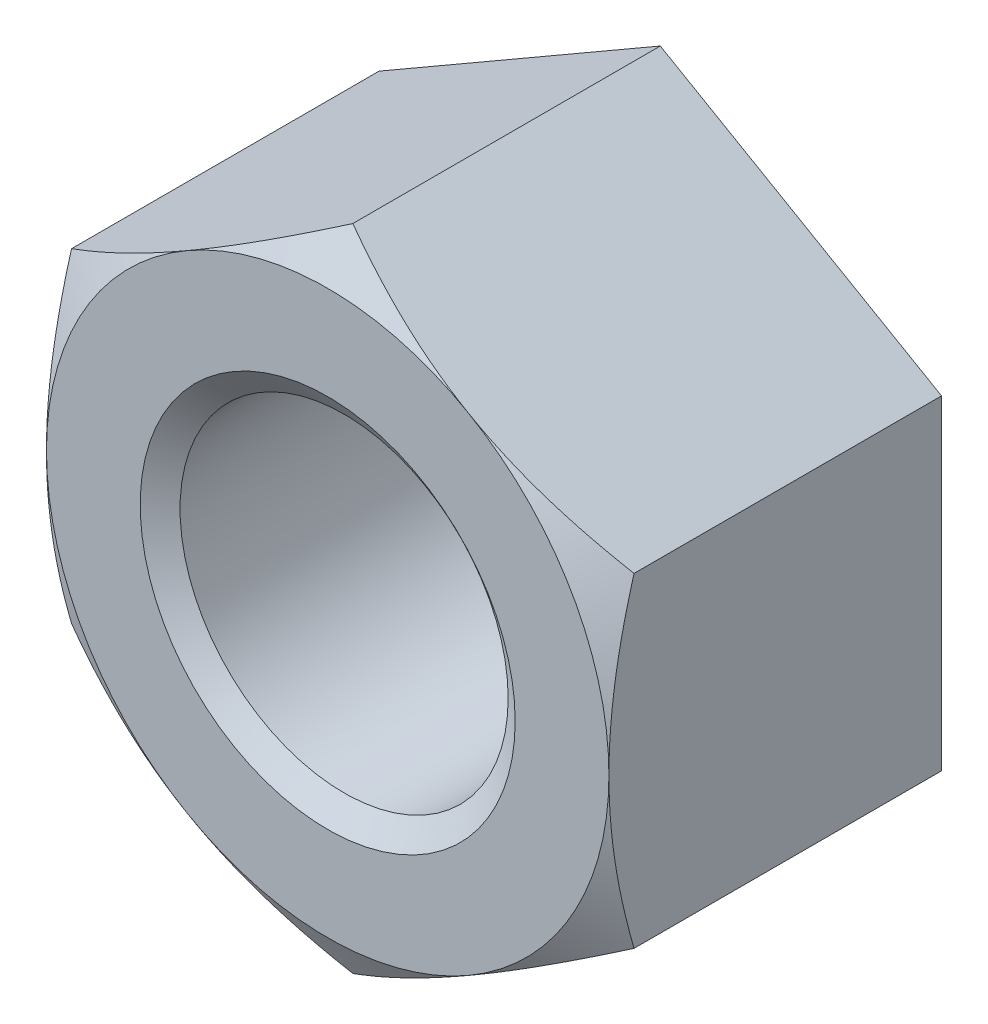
ISO-10303-21;
HEADER;
FILE_DESCRIPTION(('STEP AP214'),'2;1');
FILE_NAME('part.step','',(''),(''),'','','');
FILE_SCHEMA(('AUTOMOTIVE_DESIGN { 1 0 10303 214 1 1 1 1 }'));
ENDSEC;
DATA;
#1=APPLICATION_CONTEXT('core data for automotive mechanical design processes');
#2=APPLICATION_PROTOCOL_DEFINITION('international standard','automotive_design',2000,#1);
#3=PRODUCT_CONTEXT('',#1,'mechanical');
#4=PRODUCT('Part','Part','',(#3));
#5=PRODUCT_RELATED_PRODUCT_CATEGORY('part','',(#4));
#6=PRODUCT_DEFINITION_FORMATION('','',#4);
#7=PRODUCT_DEFINITION_CONTEXT('part definition',#1,'design');
#8=PRODUCT_DEFINITION('design','',#6,#7);
#9=PRODUCT_DEFINITION_SHAPE('','',#8);
#10=(LENGTH_UNIT() NAMED_UNIT(*) SI_UNIT(.MILLI.,.METRE.));
#11=(NAMED_UNIT(*) PLANE_ANGLE_UNIT() SI_UNIT($,.RADIAN.));
#12=(NAMED_UNIT(*) SI_UNIT($,.STERADIAN.) SOLID_ANGLE_UNIT());
#13=UNCERTAINTY_MEASURE_WITH_UNIT(LENGTH_MEASURE(1.E-05),#10,'distance_accuracy_value','');
#14=(GEOMETRIC_REPRESENTATION_CONTEXT(3) GLOBAL_UNCERTAINTY_ASSIGNED_CONTEXT((#13)) GLOBAL_UNIT_ASSIGNED_CONTEXT((#10,
#11,#12)) REPRESENTATION_CONTEXT('',''));
#15=CARTESIAN_POINT('',(0.,0.,0.));
#16=DIRECTION('',(0.,0.,1.));
#17=DIRECTION('',(1.,0.,0.));
#18=AXIS2_PLACEMENT_3D('',#15,#16,#17);
#19=CARTESIAN_POINT('',(0.,0.,-22.5298));
#20=DIRECTION('',(0.,0.,1.));
#21=DIRECTION('',(1.,0.,0.));
#22=AXIS2_PLACEMENT_3D('',#19,#20,#21);
#23=CYLINDRICAL_SURFACE('',#22,11.1125);
#24=CARTESIAN_POINT('',(0.,0.,-1.11157946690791));
#25=DIRECTION('',(0.,0.,1.));
#26=DIRECTION('',(1.,0.,0.));
#27=AXIS2_PLACEMENT_3D('',#24,#25,#26);
#28=CIRCLE('',#27,11.1125);
#29=CARTESIAN_POINT('',(11.1125,0.,-1.11157946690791));
#30=VERTEX_POINT('',#29);
#31=EDGE_CURVE('E130',#30,#30,#28,.F.);
#32=ORIENTED_EDGE('',*,*,#31,.F.);
#33=EDGE_LOOP('',(#32));
#34=FACE_BOUND('',#33,.T.);
#35=CARTESIAN_POINT('',(0.,0.,-21.3928205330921));
#36=DIRECTION('',(0.,0.,-1.));
#37=DIRECTION('',(-1.,0.,0.));
#38=AXIS2_PLACEMENT_3D('',#35,#36,#37);
#39=CIRCLE('',#38,11.1125);
#40=CARTESIAN_POINT('',(-11.1125,0.,-21.3928205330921));
#41=VERTEX_POINT('',#40);
#42=EDGE_CURVE('E40',#41,#41,#39,.F.);
#43=ORIENTED_EDGE('',*,*,#42,.F.);
#44=EDGE_LOOP('',(#43));
#45=FACE_BOUND('',#44,.T.);
#46=ADVANCED_FACE('F35',(#34,#45),#23,.F.);
#47=CARTESIAN_POINT('',(0.,21.9970452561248,-22.5298));
#48=DIRECTION('',(-0.500000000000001,0.866025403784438,0.));
#49=DIRECTION('',(-0.866025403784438,-0.500000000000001,0.));
#50=AXIS2_PLACEMENT_3D('',#47,#48,#49);
#51=PLANE('',#50);
#52=DIRECTION('',(0.,0.,1.));
#53=VECTOR('',#52,1.);
#54=CARTESIAN_POINT('',(-19.05,10.9985226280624,-22.5298));
#55=LINE('',#54,#53);
#56=CARTESIAN_POINT('',(-19.05,10.9985226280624,-22.5298));
#57=VERTEX_POINT('',#56);
#58=CARTESIAN_POINT('',(-19.05,10.9985226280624,-1.70147737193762));
#59=VERTEX_POINT('',#58);
#60=EDGE_CURVE('E242',#57,#59,#55,.T.);
#61=ORIENTED_EDGE('',*,*,#60,.T.);
#62=CARTESIAN_POINT('',(-19.0502,10.9984071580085,-1.70154403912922));
#63=CARTESIAN_POINT('',(-18.6314889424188,11.2401500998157,-1.56198341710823));
#64=CARTESIAN_POINT('',(-18.2111446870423,11.4828359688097,-1.42875584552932));
#65=CARTESIAN_POINT('',(-17.3670855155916,11.9701537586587,-1.17672716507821));
#66=CARTESIAN_POINT('',(-16.9433695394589,12.2147862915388,-1.05793080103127));
#67=CARTESIAN_POINT('',(-16.0917480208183,12.7064702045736,-0.836361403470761));
#68=CARTESIAN_POINT('',(-15.6638350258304,12.9535258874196,-0.733626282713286));
#69=CARTESIAN_POINT('',(-14.8050356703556,13.4493539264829,-0.54638543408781));
#70=CARTESIAN_POINT('',(-14.374149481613,13.6981261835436,-0.461878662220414));
#71=CARTESIAN_POINT('',(-13.5204444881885,14.1910129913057,-0.314688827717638));
#72=CARTESIAN_POINT('',(-13.0976890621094,14.4350909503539,-0.2515185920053));
#73=CARTESIAN_POINT('',(-12.250241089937,14.9243652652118,-0.145596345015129));
#74=CARTESIAN_POINT('',(-11.8255485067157,15.1695616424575,-0.102844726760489));
#75=CARTESIAN_POINT('',(-10.9754499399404,15.6603662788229,-0.0388391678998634));
#76=CARTESIAN_POINT('',(-10.5500454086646,15.9059736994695,-0.0175596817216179));
#77=CARTESIAN_POINT('',(-9.6988436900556,16.397415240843,0.00304398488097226));
#78=CARTESIAN_POINT('',(-9.27304651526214,16.6432493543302,0.00236884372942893));
#79=CARTESIAN_POINT('',(-8.47700964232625,17.1028414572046,-0.0194033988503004));
#80=CARTESIAN_POINT('',(-8.10671322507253,17.316632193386,-0.0378455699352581));
#81=CARTESIAN_POINT('',(-7.36700369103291,17.7437036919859,-0.0909844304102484));
#82=CARTESIAN_POINT('',(-6.99759056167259,17.9569844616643,-0.125680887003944));
#83=CARTESIAN_POINT('',(-6.25978756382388,18.3829552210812,-0.210726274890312));
#84=CARTESIAN_POINT('',(-5.89139892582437,18.5956445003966,-0.261089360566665));
#85=CARTESIAN_POINT('',(-5.15637533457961,19.0200105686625,-0.376579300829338));
#86=CARTESIAN_POINT('',(-4.78974037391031,19.2316873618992,-0.441706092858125));
#87=CARTESIAN_POINT('',(-3.67677271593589,19.8742595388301,-0.660888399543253));
#88=CARTESIAN_POINT('',(-2.93366305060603,20.3032941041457,-0.836799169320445));
#89=CARTESIAN_POINT('',(-1.45852420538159,21.1549659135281,-1.23604434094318));
#90=CARTESIAN_POINT('',(-0.726476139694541,21.5776140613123,-1.45928498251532));
#91=CARTESIAN_POINT('',(0.000200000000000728,21.9971607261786,-1.70154403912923));
#92=B_SPLINE_CURVE_WITH_KNOTS('',3,(#62,#63,#64,#65,#66,#67,#68,#69,#70,#71,#72,#73,#74,#75,#76,
#77,#78,#79,#80,#81,#82,#83,#84,#85,#86,#87,#88,#89,#90,#91),.UNSPECIFIED.,.F.,.F.,(4,2,2,2,2,2,
2,2,2,2,2,2,2,2,4),(0.,1.50971559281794,3.01992622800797,4.53364959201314,6.04728623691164,
7.52356313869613,8.99986845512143,10.4744153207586,11.9489166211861,13.2325441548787,
14.5161533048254,15.8009255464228,17.085692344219,19.7118183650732,22.3327898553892),.UNSPECIFIED.);
#93=CARTESIAN_POINT('',(-9.52500000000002,16.4977839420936,0.));
#94=VERTEX_POINT('',#93);
#95=EDGE_CURVE('E62',#59,#94,#92,.T.);
#96=ORIENTED_EDGE('',*,*,#95,.T.);
#97=CARTESIAN_POINT('',(0.,21.9970452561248,-1.70147737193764));
#98=VERTEX_POINT('',#97);
#99=EDGE_CURVE('E122',#94,#98,#92,.T.);
#100=ORIENTED_EDGE('',*,*,#99,.T.);
#101=DIRECTION('',(0.,0.,1.));
#102=VECTOR('',#101,1.);
#103=CARTESIAN_POINT('',(0.,21.9970452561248,-22.5298));
#104=LINE('',#103,#102);
#105=CARTESIAN_POINT('',(0.,21.9970452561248,-22.5298));
#106=VERTEX_POINT('',#105);
#107=EDGE_CURVE('E135',#106,#98,#104,.T.);
#108=ORIENTED_EDGE('',*,*,#107,.F.);
#109=DIRECTION('',(-0.866025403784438,-0.500000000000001,0.));
#110=VECTOR('',#109,1.);
#111=CARTESIAN_POINT('',(0.,21.9970452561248,-22.5298));
#112=LINE('',#111,#110);
#113=EDGE_CURVE('E136',#106,#57,#112,.T.);
#114=ORIENTED_EDGE('',*,*,#113,.T.);
#115=EDGE_LOOP('',(#61,#96,#100,#108,#114));
#116=FACE_BOUND('',#115,.T.);
#117=ADVANCED_FACE('F37',(#116),#51,.T.);
#118=CARTESIAN_POINT('',(19.05,10.9985226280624,-22.5298));
#119=DIRECTION('',(0.500000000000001,0.866025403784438,0.));
#120=DIRECTION('',(-0.866025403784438,0.500000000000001,0.));
#121=AXIS2_PLACEMENT_3D('',#118,#119,#120);
#122=PLANE('',#121);
#123=ORIENTED_EDGE('',*,*,#107,.T.);
#124=CARTESIAN_POINT('',(-0.000200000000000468,21.9971607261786,-1.70154403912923));
#125=CARTESIAN_POINT('',(0.418511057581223,21.7554177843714,-1.56198341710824));
#126=CARTESIAN_POINT('',(0.83885531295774,21.5127319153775,-1.42875584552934));
#127=CARTESIAN_POINT('',(1.68291448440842,21.0254141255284,-1.17672716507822));
#128=CARTESIAN_POINT('',(2.10663046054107,20.7807815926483,-1.05793080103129));
#129=CARTESIAN_POINT('',(2.95825197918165,20.2890976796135,-0.83636140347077));
#130=CARTESIAN_POINT('',(3.38616497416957,20.0420419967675,-0.733626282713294));
#131=CARTESIAN_POINT('',(4.24496432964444,19.5462139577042,-0.546385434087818));
#132=CARTESIAN_POINT('',(4.67585051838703,19.2974417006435,-0.461878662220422));
#133=CARTESIAN_POINT('',(5.52955551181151,18.8045548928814,-0.314688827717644));
#134=CARTESIAN_POINT('',(5.95231093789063,18.5604769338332,-0.251518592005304));
#135=CARTESIAN_POINT('',(6.79975891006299,18.0712026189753,-0.145596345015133));
#136=CARTESIAN_POINT('',(7.22445149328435,17.8260062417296,-0.102844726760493));
#137=CARTESIAN_POINT('',(8.07455006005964,17.3352016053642,-0.0388391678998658));
#138=CARTESIAN_POINT('',(8.49995459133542,17.0895941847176,-0.0175596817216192));
#139=CARTESIAN_POINT('',(9.35115630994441,16.5981526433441,0.00304398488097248));
#140=CARTESIAN_POINT('',(9.77695348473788,16.3523185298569,0.00236884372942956));
#141=CARTESIAN_POINT('',(10.5729903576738,15.8927264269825,-0.0194033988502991));
#142=CARTESIAN_POINT('',(10.9432867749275,15.6789356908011,-0.0378455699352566));
#143=CARTESIAN_POINT('',(11.6829963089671,15.2518641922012,-0.0909844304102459));
#144=CARTESIAN_POINT('',(12.0524094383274,15.0385834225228,-0.12568088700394));
#145=CARTESIAN_POINT('',(12.7902124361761,14.612612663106,-0.210726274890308));
#146=CARTESIAN_POINT('',(13.1586010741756,14.3999233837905,-0.261089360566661));
#147=CARTESIAN_POINT('',(13.8936246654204,13.9755573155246,-0.376579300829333));
#148=CARTESIAN_POINT('',(14.2602596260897,13.7638805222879,-0.441706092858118));
#149=CARTESIAN_POINT('',(15.3732272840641,13.121308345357,-0.660888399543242));
#150=CARTESIAN_POINT('',(16.116336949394,12.6922737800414,-0.836799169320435));
#151=CARTESIAN_POINT('',(17.5914757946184,11.840601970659,-1.23604434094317));
#152=CARTESIAN_POINT('',(18.3235238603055,11.4179538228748,-1.45928498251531));
#153=CARTESIAN_POINT('',(19.0502,10.9984071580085,-1.70154403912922));
#154=B_SPLINE_CURVE_WITH_KNOTS('',3,(#124,#125,#126,#127,#128,#129,#130,#131,#132,#133,#134,
#135,#136,#137,#138,#139,#140,#141,#142,#143,#144,#145,#146,#147,#148,#149,#150,#151,#152,#153),
.UNSPECIFIED.,.F.,.F.,(4,2,2,2,2,2,2,2,2,2,2,2,2,2,4),(0.,1.50971559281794,3.01992622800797,
4.53364959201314,6.04728623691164,7.52356313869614,8.99986845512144,10.4744153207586,
11.9489166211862,13.2325441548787,14.5161533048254,15.8009255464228,17.085692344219,
19.7118183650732,22.3327898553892),.UNSPECIFIED.);
#155=CARTESIAN_POINT('',(9.52500000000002,16.4977839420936,0.));
#156=VERTEX_POINT('',#155);
#157=EDGE_CURVE('E117',#98,#156,#154,.T.);
#158=ORIENTED_EDGE('',*,*,#157,.T.);
#159=CARTESIAN_POINT('',(19.05,10.9985226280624,-1.70147737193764));
#160=VERTEX_POINT('',#159);
#161=EDGE_CURVE('E109',#156,#160,#154,.T.);
#162=ORIENTED_EDGE('',*,*,#161,.T.);
#163=DIRECTION('',(0.,0.,1.));
#164=VECTOR('',#163,1.);
#165=CARTESIAN_POINT('',(19.05,10.9985226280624,-22.5298));
#166=LINE('',#165,#164);
#167=CARTESIAN_POINT('',(19.05,10.9985226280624,-22.5298));
#168=VERTEX_POINT('',#167);
#169=EDGE_CURVE('E254',#168,#160,#166,.T.);
#170=ORIENTED_EDGE('',*,*,#169,.F.);
#171=DIRECTION('',(-0.866025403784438,0.500000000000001,0.));
#172=VECTOR('',#171,1.);
#173=CARTESIAN_POINT('',(19.05,10.9985226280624,-22.5298));
#174=LINE('',#173,#172);
#175=EDGE_CURVE('E246',#168,#106,#174,.T.);
#176=ORIENTED_EDGE('',*,*,#175,.T.);
#177=EDGE_LOOP('',(#123,#158,#162,#170,#176));
#178=FACE_BOUND('',#177,.T.);
#179=ADVANCED_FACE('F133',(#178),#122,.T.);
#180=CARTESIAN_POINT('',(19.05,10.9985226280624,-22.5298));
#181=DIRECTION('',(-1.,0.,0.));
#182=DIRECTION('',(0.,0.,1.));
#183=AXIS2_PLACEMENT_3D('',#180,#181,#182);
#184=PLANE('',#183);
#185=CARTESIAN_POINT('',(19.05,-29.169702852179,-9.11593373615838));
#186=CARTESIAN_POINT('',(19.05,-28.7515170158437,-8.91378890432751));
#187=CARTESIAN_POINT('',(19.05,-28.3328257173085,-8.71269026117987));
#188=CARTESIAN_POINT('',(19.05,-27.494325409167,-8.31282549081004));
#189=CARTESIAN_POINT('',(19.05,-27.0745163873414,-8.11405938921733));
#190=CARTESIAN_POINT('',(19.05,-25.813129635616,-7.52156252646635));
#191=CARTESIAN_POINT('',(19.05,-24.9697281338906,-7.13169909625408));
#192=CARTESIAN_POINT('',(19.05,-23.2722707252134,-6.36257122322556));
#193=CARTESIAN_POINT('',(19.05,-22.4181814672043,-5.983380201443));
#194=CARTESIAN_POINT('',(19.05,-20.7029839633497,-5.24127883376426));
#195=CARTESIAN_POINT('',(19.05,-19.8418760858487,-4.87836763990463));
#196=CARTESIAN_POINT('',(19.05,-18.1005821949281,-4.16885698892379));
#197=CARTESIAN_POINT('',(19.05,-17.2202917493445,-3.82251248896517));
#198=CARTESIAN_POINT('',(19.05,-15.4493217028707,-3.15694792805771));
#199=CARTESIAN_POINT('',(19.05,-14.5586409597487,-2.83773088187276));
#200=CARTESIAN_POINT('',(19.05,-12.7673320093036,-2.23500280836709));
#201=CARTESIAN_POINT('',(19.05,-11.8667295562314,-1.95141586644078));
#202=CARTESIAN_POINT('',(19.05,-10.0526343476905,-1.4291439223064));
#203=CARTESIAN_POINT('',(19.05,-9.13914576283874,-1.19044473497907));
#204=CARTESIAN_POINT('',(19.05,-7.75907469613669,-0.87479986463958));
#205=CARTESIAN_POINT('',(19.05,-7.29731333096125,-0.77663607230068));
#206=CARTESIAN_POINT('',(19.05,-6.37071732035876,-0.595993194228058));
#207=CARTESIAN_POINT('',(19.05,-5.90588274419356,-0.513513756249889));
#208=CARTESIAN_POINT('',(19.05,-4.97345228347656,-0.365701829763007));
#209=CARTESIAN_POINT('',(19.05,-4.50585623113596,-0.300370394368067));
#210=CARTESIAN_POINT('',(19.05,-3.56843861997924,-0.188166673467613));
#211=CARTESIAN_POINT('',(19.05,-3.09861705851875,-0.141294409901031));
#212=CARTESIAN_POINT('',(19.05,-2.16041609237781,-0.0672708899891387));
#213=CARTESIAN_POINT('',(19.05,-1.69204648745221,-0.039996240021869));
#214=CARTESIAN_POINT('',(19.05,-0.754574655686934,-0.00531133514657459));
#215=CARTESIAN_POINT('',(19.05,-0.285472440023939,0.00209921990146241));
#216=CARTESIAN_POINT('',(19.05,0.652492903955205,-0.00311981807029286));
#217=CARTESIAN_POINT('',(19.05,1.12135606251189,-0.0157438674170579));
#218=CARTESIAN_POINT('',(19.05,2.05813737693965,-0.0607182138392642));
#219=CARTESIAN_POINT('',(19.05,2.52605549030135,-0.0930693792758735));
#220=CARTESIAN_POINT('',(19.05,3.65980250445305,-0.194680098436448));
#221=CARTESIAN_POINT('',(19.05,4.32476458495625,-0.273803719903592));
#222=CARTESIAN_POINT('',(19.05,5.64947952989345,-0.467485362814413));
#223=CARTESIAN_POINT('',(19.05,6.30923160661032,-0.582048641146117));
#224=CARTESIAN_POINT('',(19.05,8.28182382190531,-0.973151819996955));
#225=CARTESIAN_POINT('',(19.05,9.58542312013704,-1.29684470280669));
#226=CARTESIAN_POINT('',(19.05,11.5353898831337,-1.85499845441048));
#227=CARTESIAN_POINT('',(19.05,12.191945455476,-2.05588340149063));
#228=CARTESIAN_POINT('',(19.05,13.498713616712,-2.47768236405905));
#229=CARTESIAN_POINT('',(19.05,14.1489256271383,-2.69859818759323));
#230=CARTESIAN_POINT('',(19.05,15.439765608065,-3.15575174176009));
#231=CARTESIAN_POINT('',(19.05,16.0804269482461,-3.39189604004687));
#232=CARTESIAN_POINT('',(19.05,17.0373840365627,-3.75633654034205));
#233=CARTESIAN_POINT('',(19.05,17.3556458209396,-3.87949985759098));
#234=CARTESIAN_POINT('',(19.05,17.9909330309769,-4.12895791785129));
#235=CARTESIAN_POINT('',(19.05,18.3079584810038,-4.25525259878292));
#236=CARTESIAN_POINT('',(19.05,18.6244086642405,-4.38297164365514));
#237=B_SPLINE_CURVE_WITH_KNOTS('',3,(#185,#186,#187,#188,#189,#190,#191,#192,#193,#194,#195,
#196,#197,#198,#199,#200,#201,#202,#203,#204,#205,#206,#207,#208,#209,#210,#211,#212,#213,#214,
#215,#216,#217,#218,#219,#220,#221,#222,#223,#224,#225,#226,#227,#228,#229,#230,#231,#232,#233,
#234,#235,#236),.UNSPECIFIED.,.F.,.F.,(4,2,2,2,2,2,2,2,2,2,2,2,2,2,2,2,2,2,2,2,2,2,2,2,2,4),(0.,
1.39343811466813,2.78689152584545,5.57425145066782,8.37756231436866,11.1807269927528,
14.0183059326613,16.856199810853,19.6879407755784,22.5187853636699,23.934802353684,
25.3507875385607,26.766859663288,28.1829334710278,29.5900111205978,30.9970675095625,
32.4037346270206,33.8104636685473,35.8182820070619,37.8263983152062,41.8503661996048,
43.910005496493,45.9698308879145,48.018040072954,49.0418117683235,50.0655631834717),.UNSPECIFIED.);
#238=CARTESIAN_POINT('',(19.05,-10.9985226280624,-1.70147737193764));
#239=VERTEX_POINT('',#238);
#240=CARTESIAN_POINT('',(19.05,0.,0.));
#241=VERTEX_POINT('',#240);
#242=EDGE_CURVE('E189',#239,#241,#237,.T.);
#243=ORIENTED_EDGE('',*,*,#242,.F.);
#244=DIRECTION('',(0.,0.,1.));
#245=VECTOR('',#244,1.);
#246=CARTESIAN_POINT('',(19.05,-10.9985226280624,-22.5298));
#247=LINE('',#246,#245);
#248=CARTESIAN_POINT('',(19.05,-10.9985226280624,-22.5298));
#249=VERTEX_POINT('',#248);
#250=EDGE_CURVE('E251',#249,#239,#247,.T.);
#251=ORIENTED_EDGE('',*,*,#250,.F.);
#252=DIRECTION('',(0.,-1.,0.));
#253=VECTOR('',#252,1.);
#254=CARTESIAN_POINT('',(19.05,10.9985226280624,-22.5298));
#255=LINE('',#254,#253);
#256=EDGE_CURVE('E258',#168,#249,#255,.T.);
#257=ORIENTED_EDGE('',*,*,#256,.F.);
#258=ORIENTED_EDGE('',*,*,#169,.T.);
#259=EDGE_CURVE('E113',#241,#160,#237,.T.);
#260=ORIENTED_EDGE('',*,*,#259,.F.);
#261=EDGE_LOOP('',(#243,#251,#257,#258,#260));
#262=FACE_BOUND('',#261,.T.);
#263=ADVANCED_FACE('F195',(#262),#184,.F.);
#264=CARTESIAN_POINT('',(0.,-21.9970452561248,-22.5298));
#265=DIRECTION('',(0.500000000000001,-0.866025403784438,0.));
#266=DIRECTION('',(0.866025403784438,0.500000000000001,0.));
#267=AXIS2_PLACEMENT_3D('',#264,#265,#266);
#268=PLANE('',#267);
#269=ORIENTED_EDGE('',*,*,#250,.T.);
#270=CARTESIAN_POINT('',(19.0502,-10.9984071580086,-1.70154403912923));
#271=CARTESIAN_POINT('',(18.6314889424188,-11.2401500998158,-1.56198341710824));
#272=CARTESIAN_POINT('',(18.2111446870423,-11.4828359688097,-1.42875584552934));
#273=CARTESIAN_POINT('',(17.3670855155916,-11.9701537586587,-1.17672716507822));
#274=CARTESIAN_POINT('',(16.9433695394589,-12.2147862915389,-1.05793080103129));
#275=CARTESIAN_POINT('',(16.0917480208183,-12.7064702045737,-0.836361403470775));
#276=CARTESIAN_POINT('',(15.6638350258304,-12.9535258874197,-0.733626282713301));
#277=CARTESIAN_POINT('',(14.8050356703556,-13.449353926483,-0.546385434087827));
#278=CARTESIAN_POINT('',(14.374149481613,-13.6981261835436,-0.46187866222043));
#279=CARTESIAN_POINT('',(13.5204444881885,-14.1910129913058,-0.314688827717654));
#280=CARTESIAN_POINT('',(13.0976890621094,-14.4350909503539,-0.251518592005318));
#281=CARTESIAN_POINT('',(12.250241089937,-14.9243652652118,-0.145596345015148));
#282=CARTESIAN_POINT('',(11.8255485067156,-15.1695616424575,-0.102844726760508));
#283=CARTESIAN_POINT('',(10.9754499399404,-15.660366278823,-0.0388391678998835));
#284=CARTESIAN_POINT('',(10.5500454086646,-15.9059736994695,-0.0175596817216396));
#285=CARTESIAN_POINT('',(9.69884369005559,-16.3974152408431,0.00304398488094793));
#286=CARTESIAN_POINT('',(9.27304651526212,-16.6432493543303,0.00236884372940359));
#287=CARTESIAN_POINT('',(8.47700964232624,-17.1028414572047,-0.0194033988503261));
#288=CARTESIAN_POINT('',(8.10671322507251,-17.3166321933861,-0.0378455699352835));
#289=CARTESIAN_POINT('',(7.36700369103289,-17.743703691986,-0.090984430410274));
#290=CARTESIAN_POINT('',(6.99759056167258,-17.9569844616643,-0.12568088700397));
#291=CARTESIAN_POINT('',(6.25978756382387,-18.3829552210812,-0.210726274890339));
#292=CARTESIAN_POINT('',(5.89139892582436,-18.5956445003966,-0.261089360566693));
#293=CARTESIAN_POINT('',(5.1563753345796,-19.0200105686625,-0.376579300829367));
#294=CARTESIAN_POINT('',(4.7897403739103,-19.2316873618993,-0.441706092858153));
#295=CARTESIAN_POINT('',(3.67677271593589,-19.8742595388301,-0.660888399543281));
#296=CARTESIAN_POINT('',(2.93366305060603,-20.3032941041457,-0.836799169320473));
#297=CARTESIAN_POINT('',(1.45852420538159,-21.1549659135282,-1.23604434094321));
#298=CARTESIAN_POINT('',(0.726476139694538,-21.5776140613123,-1.45928498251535));
#299=CARTESIAN_POINT('',(-0.000200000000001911,-21.9971607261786,-1.70154403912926));
#300=B_SPLINE_CURVE_WITH_KNOTS('',3,(#270,#271,#272,#273,#274,#275,#276,#277,#278,#279,#280,
#281,#282,#283,#284,#285,#286,#287,#288,#289,#290,#291,#292,#293,#294,#295,#296,#297,#298,#299),
.UNSPECIFIED.,.F.,.F.,(4,2,2,2,2,2,2,2,2,2,2,2,2,2,4),(0.,1.50971559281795,3.01992622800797,
4.53364959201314,6.04728623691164,7.52356313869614,8.99986845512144,10.4744153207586,
11.9489166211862,13.2325441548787,14.5161533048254,15.8009255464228,17.085692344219,
19.7118183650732,22.3327898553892),.UNSPECIFIED.);
#301=CARTESIAN_POINT('',(9.52500000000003,-16.4977839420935,0.));
#302=VERTEX_POINT('',#301);
#303=EDGE_CURVE('E194',#239,#302,#300,.T.);
#304=ORIENTED_EDGE('',*,*,#303,.T.);
#305=CARTESIAN_POINT('',(0.,-21.9970452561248,-1.70147737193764));
#306=VERTEX_POINT('',#305);
#307=EDGE_CURVE('E183',#302,#306,#300,.T.);
#308=ORIENTED_EDGE('',*,*,#307,.T.);
#309=DIRECTION('',(0.,0.,1.));
#310=VECTOR('',#309,1.);
#311=CARTESIAN_POINT('',(0.,-21.9970452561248,-22.5298));
#312=LINE('',#311,#310);
#313=CARTESIAN_POINT('',(0.,-21.9970452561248,-22.5298));
#314=VERTEX_POINT('',#313);
#315=EDGE_CURVE('E248',#314,#306,#312,.T.);
#316=ORIENTED_EDGE('',*,*,#315,.F.);
#317=DIRECTION('',(0.866025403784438,0.500000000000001,0.));
#318=VECTOR('',#317,1.);
#319=CARTESIAN_POINT('',(0.,-21.9970452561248,-22.5298));
#320=LINE('',#319,#318);
#321=EDGE_CURVE('E260',#314,#249,#320,.T.);
#322=ORIENTED_EDGE('',*,*,#321,.T.);
#323=EDGE_LOOP('',(#269,#304,#308,#316,#322));
#324=FACE_BOUND('',#323,.T.);
#325=ADVANCED_FACE('F198',(#324),#268,.T.);
#326=CARTESIAN_POINT('',(-19.05,-10.9985226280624,-22.5298));
#327=DIRECTION('',(-0.500000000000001,-0.866025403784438,0.));
#328=DIRECTION('',(0.866025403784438,-0.500000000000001,0.));
#329=AXIS2_PLACEMENT_3D('',#326,#327,#328);
#330=PLANE('',#329);
#331=ORIENTED_EDGE('',*,*,#315,.T.);
#332=CARTESIAN_POINT('',(0.000199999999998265,-21.9971607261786,-1.70154403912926));
#333=CARTESIAN_POINT('',(-0.418511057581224,-21.7554177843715,-1.56198341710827));
#334=CARTESIAN_POINT('',(-0.838855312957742,-21.5127319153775,-1.42875584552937));
#335=CARTESIAN_POINT('',(-1.68291448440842,-21.0254141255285,-1.17672716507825));
#336=CARTESIAN_POINT('',(-2.10663046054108,-20.7807815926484,-1.05793080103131));
#337=CARTESIAN_POINT('',(-2.95825197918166,-20.2890976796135,-0.836361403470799));
#338=CARTESIAN_POINT('',(-3.38616497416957,-20.0420419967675,-0.733626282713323));
#339=CARTESIAN_POINT('',(-4.24496432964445,-19.5462139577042,-0.546385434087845));
#340=CARTESIAN_POINT('',(-4.67585051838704,-19.2974417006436,-0.461878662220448));
#341=CARTESIAN_POINT('',(-5.52955551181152,-18.8045548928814,-0.31468882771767));
#342=CARTESIAN_POINT('',(-5.95231093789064,-18.5604769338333,-0.251518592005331));
#343=CARTESIAN_POINT('',(-6.79975891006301,-18.0712026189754,-0.145596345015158));
#344=CARTESIAN_POINT('',(-7.22445149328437,-17.8260062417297,-0.102844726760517));
#345=CARTESIAN_POINT('',(-8.07455006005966,-17.3352016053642,-0.0388391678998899));
#346=CARTESIAN_POINT('',(-8.49995459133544,-17.0895941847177,-0.0175596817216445));
#347=CARTESIAN_POINT('',(-9.35115630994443,-16.5981526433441,0.0030439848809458));
#348=CARTESIAN_POINT('',(-9.7769534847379,-16.3523185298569,0.00236884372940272));
#349=CARTESIAN_POINT('',(-10.5729903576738,-15.8927264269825,-0.0194033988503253));
#350=CARTESIAN_POINT('',(-10.9432867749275,-15.6789356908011,-0.037845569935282));
#351=CARTESIAN_POINT('',(-11.6829963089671,-15.2518641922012,-0.09098443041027));
#352=CARTESIAN_POINT('',(-12.0524094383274,-15.0385834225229,-0.125680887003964));
#353=CARTESIAN_POINT('',(-12.7902124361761,-14.612612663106,-0.210726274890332));
#354=CARTESIAN_POINT('',(-13.1586010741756,-14.3999233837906,-0.261089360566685));
#355=CARTESIAN_POINT('',(-13.8936246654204,-13.9755573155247,-0.376579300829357));
#356=CARTESIAN_POINT('',(-14.2602596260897,-13.7638805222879,-0.441706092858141));
#357=CARTESIAN_POINT('',(-15.3732272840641,-13.1213083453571,-0.660888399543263));
#358=CARTESIAN_POINT('',(-16.116336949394,-12.6922737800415,-0.836799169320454));
#359=CARTESIAN_POINT('',(-17.5914757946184,-11.840601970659,-1.23604434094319));
#360=CARTESIAN_POINT('',(-18.3235238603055,-11.4179538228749,-1.45928498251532));
#361=CARTESIAN_POINT('',(-19.0502,-10.9984071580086,-1.70154403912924));
#362=B_SPLINE_CURVE_WITH_KNOTS('',3,(#332,#333,#334,#335,#336,#337,#338,#339,#340,#341,#342,
#343,#344,#345,#346,#347,#348,#349,#350,#351,#352,#353,#354,#355,#356,#357,#358,#359,#360,#361),
.UNSPECIFIED.,.F.,.F.,(4,2,2,2,2,2,2,2,2,2,2,2,2,2,4),(0.,1.50971559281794,3.01992622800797,
4.53364959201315,6.04728623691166,7.52356313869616,8.99986845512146,10.4744153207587,
11.9489166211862,13.2325441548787,14.5161533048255,15.8009255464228,17.085692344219,
19.7118183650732,22.3327898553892),.UNSPECIFIED.);
#363=CARTESIAN_POINT('',(-9.52500000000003,-16.4977839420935,0.));
#364=VERTEX_POINT('',#363);
#365=EDGE_CURVE('E282',#306,#364,#362,.T.);
#366=ORIENTED_EDGE('',*,*,#365,.T.);
#367=CARTESIAN_POINT('',(-19.05,-10.9985226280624,-1.70147737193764));
#368=VERTEX_POINT('',#367);
#369=EDGE_CURVE('E175',#364,#368,#362,.T.);
#370=ORIENTED_EDGE('',*,*,#369,.T.);
#371=DIRECTION('',(0.,0.,1.));
#372=VECTOR('',#371,1.);
#373=CARTESIAN_POINT('',(-19.05,-10.9985226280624,-22.5298));
#374=LINE('',#373,#372);
#375=CARTESIAN_POINT('',(-19.05,-10.9985226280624,-22.5298));
#376=VERTEX_POINT('',#375);
#377=EDGE_CURVE('E245',#376,#368,#374,.T.);
#378=ORIENTED_EDGE('',*,*,#377,.F.);
#379=DIRECTION('',(0.866025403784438,-0.500000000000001,0.));
#380=VECTOR('',#379,1.);
#381=CARTESIAN_POINT('',(-19.05,-10.9985226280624,-22.5298));
#382=LINE('',#381,#380);
#383=EDGE_CURVE('E263',#376,#314,#382,.T.);
#384=ORIENTED_EDGE('',*,*,#383,.T.);
#385=EDGE_LOOP('',(#331,#366,#370,#378,#384));
#386=FACE_BOUND('',#385,.T.);
#387=ADVANCED_FACE('F202',(#386),#330,.T.);
#388=CARTESIAN_POINT('',(-19.05,10.9985226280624,-22.5298));
#389=DIRECTION('',(-1.,0.,0.));
#390=DIRECTION('',(0.,0.,1.));
#391=AXIS2_PLACEMENT_3D('',#388,#389,#390);
#392=PLANE('',#391);
#393=ORIENTED_EDGE('',*,*,#377,.T.);
#394=CARTESIAN_POINT('',(-19.05,-29.169702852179,-9.11593373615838));
#395=CARTESIAN_POINT('',(-19.05,-28.7515170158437,-8.91378890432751));
#396=CARTESIAN_POINT('',(-19.05,-28.3328257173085,-8.71269026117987));
#397=CARTESIAN_POINT('',(-19.05,-27.494325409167,-8.31282549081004));
#398=CARTESIAN_POINT('',(-19.05,-27.0745163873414,-8.11405938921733));
#399=CARTESIAN_POINT('',(-19.05,-25.813129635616,-7.52156252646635));
#400=CARTESIAN_POINT('',(-19.05,-24.9697281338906,-7.13169909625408));
#401=CARTESIAN_POINT('',(-19.05,-23.2722707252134,-6.36257122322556));
#402=CARTESIAN_POINT('',(-19.05,-22.4181814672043,-5.983380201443));
#403=CARTESIAN_POINT('',(-19.05,-20.7029839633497,-5.24127883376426));
#404=CARTESIAN_POINT('',(-19.05,-19.8418760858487,-4.87836763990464));
#405=CARTESIAN_POINT('',(-19.05,-18.1005821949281,-4.1688569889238));
#406=CARTESIAN_POINT('',(-19.05,-17.2202917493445,-3.82251248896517));
#407=CARTESIAN_POINT('',(-19.05,-15.4493217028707,-3.15694792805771));
#408=CARTESIAN_POINT('',(-19.05,-14.5586409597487,-2.83773088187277));
#409=CARTESIAN_POINT('',(-19.05,-12.7673320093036,-2.23500280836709));
#410=CARTESIAN_POINT('',(-19.05,-11.8667295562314,-1.95141586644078));
#411=CARTESIAN_POINT('',(-19.05,-10.0526343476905,-1.42914392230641));
#412=CARTESIAN_POINT('',(-19.05,-9.13914576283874,-1.19044473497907));
#413=CARTESIAN_POINT('',(-19.05,-7.75907469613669,-0.874799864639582));
#414=CARTESIAN_POINT('',(-19.05,-7.29731333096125,-0.776636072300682));
#415=CARTESIAN_POINT('',(-19.05,-6.37071732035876,-0.59599319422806));
#416=CARTESIAN_POINT('',(-19.05,-5.90588274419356,-0.513513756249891));
#417=CARTESIAN_POINT('',(-19.05,-4.97345228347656,-0.365701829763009));
#418=CARTESIAN_POINT('',(-19.05,-4.50585623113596,-0.300370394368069));
#419=CARTESIAN_POINT('',(-19.05,-3.56843861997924,-0.188166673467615));
#420=CARTESIAN_POINT('',(-19.05,-3.09861705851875,-0.141294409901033));
#421=CARTESIAN_POINT('',(-19.05,-2.16041609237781,-0.0672708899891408));
#422=CARTESIAN_POINT('',(-19.05,-1.69204648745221,-0.0399962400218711));
#423=CARTESIAN_POINT('',(-19.05,-0.754574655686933,-0.00531133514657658));
#424=CARTESIAN_POINT('',(-19.05,-0.285472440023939,0.00209921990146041));
#425=CARTESIAN_POINT('',(-19.05,0.652492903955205,-0.00311981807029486));
#426=CARTESIAN_POINT('',(-19.05,1.12135606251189,-0.0157438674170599));
#427=CARTESIAN_POINT('',(-19.05,2.05813737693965,-0.0607182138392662));
#428=CARTESIAN_POINT('',(-19.05,2.52605549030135,-0.0930693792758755));
#429=CARTESIAN_POINT('',(-19.05,3.65980250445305,-0.194680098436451));
#430=CARTESIAN_POINT('',(-19.05,4.32476458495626,-0.273803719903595));
#431=CARTESIAN_POINT('',(-19.05,5.64947952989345,-0.467485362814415));
#432=CARTESIAN_POINT('',(-19.05,6.30923160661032,-0.582048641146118));
#433=CARTESIAN_POINT('',(-19.05,8.28182382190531,-0.973151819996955));
#434=CARTESIAN_POINT('',(-19.05,9.58542312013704,-1.29684470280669));
#435=CARTESIAN_POINT('',(-19.05,11.5353898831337,-1.85499845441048));
#436=CARTESIAN_POINT('',(-19.05,12.191945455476,-2.05588340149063));
#437=CARTESIAN_POINT('',(-19.05,13.498713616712,-2.47768236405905));
#438=CARTESIAN_POINT('',(-19.05,14.1489256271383,-2.69859818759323));
#439=CARTESIAN_POINT('',(-19.05,15.439765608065,-3.15575174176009));
#440=CARTESIAN_POINT('',(-19.05,16.0804269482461,-3.39189604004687));
#441=CARTESIAN_POINT('',(-19.05,17.0373840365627,-3.75633654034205));
#442=CARTESIAN_POINT('',(-19.05,17.3556458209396,-3.87949985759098));
#443=CARTESIAN_POINT('',(-19.05,17.9909330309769,-4.1289579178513));
#444=CARTESIAN_POINT('',(-19.05,18.3079584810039,-4.25525259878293));
#445=CARTESIAN_POINT('',(-19.05,18.6244086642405,-4.38297164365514));
#446=B_SPLINE_CURVE_WITH_KNOTS('',3,(#394,#395,#396,#397,#398,#399,#400,#401,#402,#403,#404,
#405,#406,#407,#408,#409,#410,#411,#412,#413,#414,#415,#416,#417,#418,#419,#420,#421,#422,#423,
#424,#425,#426,#427,#428,#429,#430,#431,#432,#433,#434,#435,#436,#437,#438,#439,#440,#441,#442,
#443,#444,#445),.UNSPECIFIED.,.F.,.F.,(4,2,2,2,2,2,2,2,2,2,2,2,2,2,2,2,2,2,2,2,2,2,2,2,2,4),(0.,
1.39343811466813,2.78689152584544,5.57425145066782,8.37756231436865,11.1807269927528,
14.0183059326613,16.856199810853,19.6879407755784,22.5187853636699,23.934802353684,
25.3507875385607,26.766859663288,28.1829334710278,29.5900111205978,30.9970675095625,
32.4037346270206,33.8104636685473,35.8182820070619,37.8263983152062,41.8503661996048,
43.910005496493,45.9698308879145,48.018040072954,49.0418117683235,50.0655631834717),.UNSPECIFIED.);
#447=CARTESIAN_POINT('',(-19.05,0.,0.));
#448=VERTEX_POINT('',#447);
#449=EDGE_CURVE('E280',#368,#448,#446,.T.);
#450=ORIENTED_EDGE('',*,*,#449,.T.);
#451=EDGE_CURVE('E129',#448,#59,#446,.T.);
#452=ORIENTED_EDGE('',*,*,#451,.T.);
#453=ORIENTED_EDGE('',*,*,#60,.F.);
#454=DIRECTION('',(0.,-1.,0.));
#455=VECTOR('',#454,1.);
#456=CARTESIAN_POINT('',(-19.05,10.9985226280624,-22.5298));
#457=LINE('',#456,#455);
#458=EDGE_CURVE('E265',#57,#376,#457,.T.);
#459=ORIENTED_EDGE('',*,*,#458,.T.);
#460=EDGE_LOOP('',(#393,#450,#452,#453,#459));
#461=FACE_BOUND('',#460,.T.);
#462=ADVANCED_FACE('F206',(#461),#392,.T.);
#463=CARTESIAN_POINT('',(-38.1,0.,0.));
#464=DIRECTION('',(0.,0.,1.));
#465=DIRECTION('',(1.,0.,0.));
#466=AXIS2_PLACEMENT_3D('',#463,#464,#465);
#467=PLANE('',#466);
#468=CARTESIAN_POINT('',(0.,0.,0.));
#469=DIRECTION('',(0.,0.,1.));
#470=DIRECTION('',(1.,0.,0.));
#471=AXIS2_PLACEMENT_3D('',#468,#469,#470);
#472=CIRCLE('',#471,12.7);
#473=CARTESIAN_POINT('',(12.7,0.,0.));
#474=VERTEX_POINT('',#473);
#475=EDGE_CURVE('E229',#474,#474,#472,.T.);
#476=ORIENTED_EDGE('',*,*,#475,.F.);
#477=EDGE_LOOP('',(#476));
#478=FACE_BOUND('',#477,.T.);
#479=CARTESIAN_POINT('',(0.,0.,0.));
#480=DIRECTION('',(0.,0.,1.));
#481=DIRECTION('',(1.,0.,0.));
#482=AXIS2_PLACEMENT_3D('',#479,#480,#481);
#483=CIRCLE('',#482,19.05);
#484=EDGE_CURVE('E47',#302,#241,#483,.T.);
#485=ORIENTED_EDGE('',*,*,#484,.T.);
#486=CARTESIAN_POINT('',(0.,0.,0.));
#487=DIRECTION('',(0.,0.,1.));
#488=DIRECTION('',(1.,0.,0.));
#489=AXIS2_PLACEMENT_3D('',#486,#487,#488);
#490=CIRCLE('',#489,19.05);
#491=EDGE_CURVE('E54',#241,#156,#490,.T.);
#492=ORIENTED_EDGE('',*,*,#491,.T.);
#493=EDGE_CURVE('E11',#156,#94,#483,.T.);
#494=ORIENTED_EDGE('',*,*,#493,.T.);
#495=EDGE_CURVE('E45',#94,#448,#483,.T.);
#496=ORIENTED_EDGE('',*,*,#495,.T.);
#497=EDGE_CURVE('E289',#448,#364,#483,.T.);
#498=ORIENTED_EDGE('',*,*,#497,.T.);
#499=EDGE_CURVE('E241',#364,#302,#483,.T.);
#500=ORIENTED_EDGE('',*,*,#499,.T.);
#501=EDGE_LOOP('',(#485,#492,#494,#496,#498,#500));
#502=FACE_BOUND('',#501,.T.);
#503=ADVANCED_FACE('F126',(#478,#502),#467,.T.);
#504=CARTESIAN_POINT('',(-38.1,0.,-22.5298));
#505=DIRECTION('',(0.,0.,1.));
#506=DIRECTION('',(1.,0.,0.));
#507=AXIS2_PLACEMENT_3D('',#504,#505,#506);
#508=PLANE('',#507);
#509=CARTESIAN_POINT('',(0.,0.,-22.5298));
#510=DIRECTION('',(0.,0.,1.));
#511=DIRECTION('',(1.,0.,0.));
#512=AXIS2_PLACEMENT_3D('',#509,#510,#511);
#513=CIRCLE('',#512,12.7);
#514=CARTESIAN_POINT('',(12.7,0.,-22.5298));
#515=VERTEX_POINT('',#514);
#516=EDGE_CURVE('E230',#515,#515,#513,.F.);
#517=ORIENTED_EDGE('',*,*,#516,.F.);
#518=EDGE_LOOP('',(#517));
#519=FACE_BOUND('',#518,.T.);
#520=ORIENTED_EDGE('',*,*,#113,.F.);
#521=ORIENTED_EDGE('',*,*,#175,.F.);
#522=ORIENTED_EDGE('',*,*,#256,.T.);
#523=ORIENTED_EDGE('',*,*,#321,.F.);
#524=ORIENTED_EDGE('',*,*,#383,.F.);
#525=ORIENTED_EDGE('',*,*,#458,.F.);
#526=EDGE_LOOP('',(#520,#521,#522,#523,#524,#525));
#527=FACE_BOUND('',#526,.T.);
#528=ADVANCED_FACE('F214',(#519,#527),#508,.F.);
#529=CARTESIAN_POINT('',(0.,0.,0.));
#530=DIRECTION('',(0.,0.,-1.));
#531=DIRECTION('',(-1.,0.,0.));
#532=AXIS2_PLACEMENT_3D('',#529,#530,#531);
#533=CONICAL_SURFACE('',#532,19.05,1.0471975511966);
#534=ORIENTED_EDGE('',*,*,#242,.T.);
#535=ORIENTED_EDGE('',*,*,#484,.F.);
#536=ORIENTED_EDGE('',*,*,#303,.F.);
#537=EDGE_LOOP('',(#534,#535,#536));
#538=FACE_BOUND('',#537,.T.);
#539=ADVANCED_FACE('F286',(#538),#533,.T.);
#540=ORIENTED_EDGE('',*,*,#499,.F.);
#541=ORIENTED_EDGE('',*,*,#365,.F.);
#542=ORIENTED_EDGE('',*,*,#307,.F.);
#543=EDGE_LOOP('',(#540,#541,#542));
#544=FACE_BOUND('',#543,.T.);
#545=ADVANCED_FACE('F160',(#544),#533,.T.);
#546=ORIENTED_EDGE('',*,*,#497,.F.);
#547=ORIENTED_EDGE('',*,*,#449,.F.);
#548=ORIENTED_EDGE('',*,*,#369,.F.);
#549=EDGE_LOOP('',(#546,#547,#548));
#550=FACE_BOUND('',#549,.T.);
#551=ADVANCED_FACE('F154',(#550),#533,.T.);
#552=ORIENTED_EDGE('',*,*,#451,.F.);
#553=ORIENTED_EDGE('',*,*,#495,.F.);
#554=ORIENTED_EDGE('',*,*,#95,.F.);
#555=EDGE_LOOP('',(#552,#553,#554));
#556=FACE_BOUND('',#555,.T.);
#557=ADVANCED_FACE('F159',(#556),#533,.T.);
#558=ORIENTED_EDGE('',*,*,#493,.F.);
#559=ORIENTED_EDGE('',*,*,#157,.F.);
#560=ORIENTED_EDGE('',*,*,#99,.F.);
#561=EDGE_LOOP('',(#558,#559,#560));
#562=FACE_BOUND('',#561,.T.);
#563=ADVANCED_FACE('F120',(#562),#533,.T.);
#564=ORIENTED_EDGE('',*,*,#491,.F.);
#565=ORIENTED_EDGE('',*,*,#259,.T.);
#566=ORIENTED_EDGE('',*,*,#161,.F.);
#567=EDGE_LOOP('',(#564,#565,#566));
#568=FACE_BOUND('',#567,.T.);
#569=ADVANCED_FACE('F111',(#568),#533,.T.);
#570=CARTESIAN_POINT('',(0.,0.,-1.22273741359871));
#571=DIRECTION('',(0.,0.,1.));
#572=DIRECTION('',(1.,0.,0.));
#573=AXIS2_PLACEMENT_3D('',#570,#571,#572);
#574=CONICAL_SURFACE('',#573,10.95375,0.959931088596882);
#575=ORIENTED_EDGE('',*,*,#475,.T.);
#576=EDGE_LOOP('',(#575));
#577=FACE_BOUND('',#576,.T.);
#578=ORIENTED_EDGE('',*,*,#31,.T.);
#579=EDGE_LOOP('',(#578));
#580=FACE_BOUND('',#579,.T.);
#581=ADVANCED_FACE('F162',(#577,#580),#574,.F.);
#582=CARTESIAN_POINT('',(0.,0.,-22.5044));
#583=DIRECTION('',(0.,0.,-1.));
#584=DIRECTION('',(-1.,0.,0.));
#585=AXIS2_PLACEMENT_3D('',#582,#583,#584);
#586=CONICAL_SURFACE('',#585,12.7,0.95993108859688);
#587=CARTESIAN_POINT('',(0.,0.,-22.5044));
#588=DIRECTION('',(0.,0.,1.));
#589=DIRECTION('',(1.,0.,0.));
#590=AXIS2_PLACEMENT_3D('',#587,#588,#589);
#591=CIRCLE('',#590,12.7);
#592=CARTESIAN_POINT('',(12.7,0.,-22.5044));
#593=VERTEX_POINT('',#592);
#594=EDGE_CURVE('E234',#593,#593,#591,.T.);
#595=ORIENTED_EDGE('',*,*,#594,.F.);
#596=EDGE_LOOP('',(#595));
#597=FACE_BOUND('',#596,.T.);
#598=ORIENTED_EDGE('',*,*,#42,.T.);
#599=EDGE_LOOP('',(#598));
#600=FACE_BOUND('',#599,.T.);
#601=ADVANCED_FACE('F305',(#597,#600),#586,.F.);
#602=CARTESIAN_POINT('',(0.,0.,-25.0375057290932));
#603=DIRECTION('',(0.,0.,1.));
#604=DIRECTION('',(1.,0.,0.));
#605=AXIS2_PLACEMENT_3D('',#602,#603,#604);
#606=CYLINDRICAL_SURFACE('',#605,12.7);
#607=ORIENTED_EDGE('',*,*,#594,.T.);
#608=EDGE_LOOP('',(#607));
#609=FACE_BOUND('',#608,.T.);
#610=ORIENTED_EDGE('',*,*,#516,.T.);
#611=EDGE_LOOP('',(#610));
#612=FACE_BOUND('',#611,.T.);
#613=ADVANCED_FACE('F310',(#609,#612),#606,.F.);
#614=CLOSED_SHELL('',(#46,#117,#179,#263,#325,#387,#462,#503,#528,#539,#545,#551,#557,#563,#569,
#581,#601,#613));
#615=MANIFOLD_SOLID_BREP('B2',#614);
#616=ADVANCED_BREP_SHAPE_REPRESENTATION('',(#18,#615),#14);
#617=SHAPE_DEFINITION_REPRESENTATION(#9,#616);
ENDSEC;
END-ISO-10303-21;
